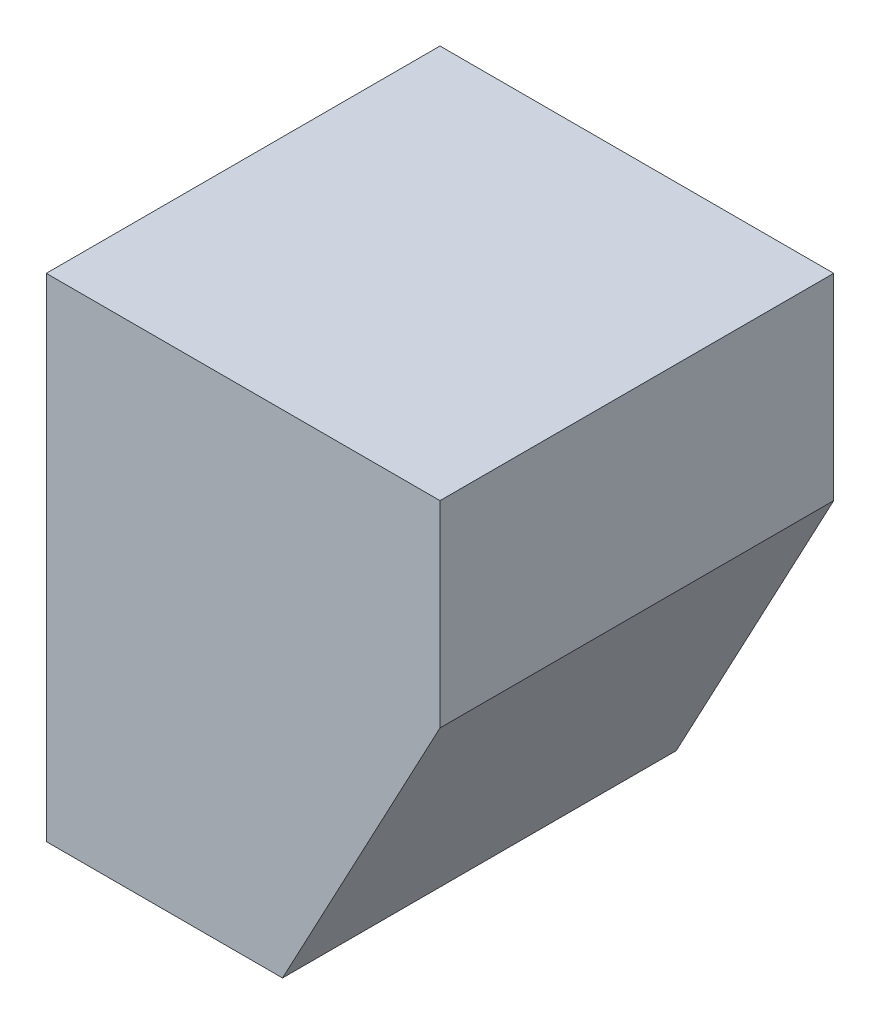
from build123d import *

# Parameters (mm, degrees)
BOSS_EXTRU_1_DEPTH = 10


with BuildPart() as part:
    # Esquisse1 → Boss.-Extru.1 (new, symmetric)
    with BuildSketch(Plane.XY):
        Polygon((-42.820550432, 43.317099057), (-42.820550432, 18.317099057), (-30.820550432, 18.317099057), (-22.820550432, 33.317099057), (-22.820550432, 43.317099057), align=None)
    extrude(amount=BOSS_EXTRU_1_DEPTH, both=True)


solid = part.part
